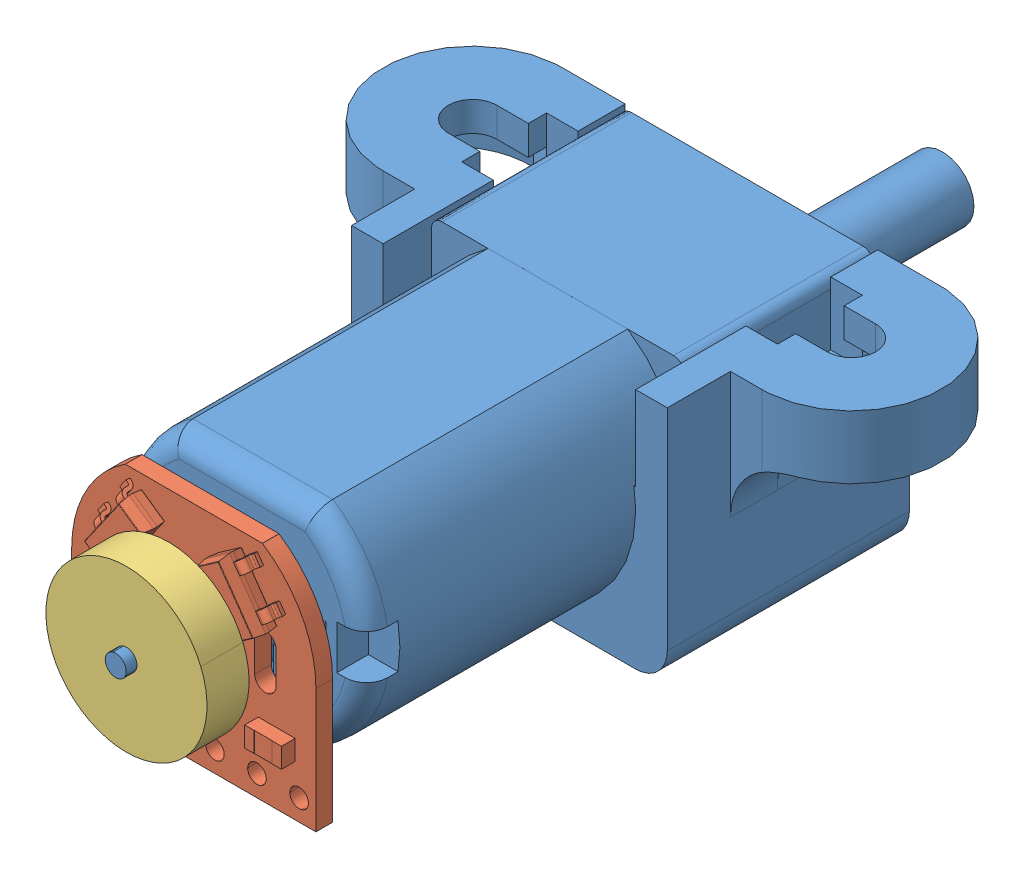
SolidWorks assembly Assem-motor.SLDASM, configuration Default (file format 14000). Lengths in mm.
Overall size (26.51 11.71 39.27).
3 component instances, 3 part files, 5 mates.
Components (placement in the parent):
- motor dual shaft-1: motor dual shaft.SLDPRT [Default] at (14.3298 18 -34.4067) x (0 0 -1) z (-1 0 0) size (39.27 11.71 26.51)
- motor-encoder1-1: motor-encoder1.SLDPRT [Default] at (14.3298 18 -17.9067) size (11.6 10.6 1.99)
- motor-encoder2-1: motor-encoder2.SLDPRT [Default] at (14.3298 18 -13.9167) x (-0.923728 -0.383049 0) z (0 0 -1) size (7.65 7.65 2)
Mates (geometry in assembly coordinates):
- Coincident6: coincident anti-aligned: plane of motor-encoder1-1 through (12.6867 19.95 -15.9167) normal (0 0 1); plane of motor-encoder2-1 through (14.3298 18 -15.9167) normal (0 0 -1)
- Concentric4: concentric anti-aligned: cylinder of motor-encoder1-1 through (14.3298 18 -17.1167) axis (0 0 -1) radius 0.8128; cylinder of motor-encoder2-1 through (14.3298 18 -15.9167) axis (0 0 1) radius 0.5
- Coincident7: coincident anti-aligned: plane of motor dual shaft-1 through (14.3298 18 -17.9067) normal (0 0 1); plane of motor-encoder1-1 through (14.5113 18.0974 -17.9067) normal (0 0 -1)
- Concentric5: concentric anti-aligned: cylinder of motor dual shaft-1 through (14.3298 18 -13.4067) axis (0 0 -1) radius 0.5; cylinder of motor-encoder2-1 through (14.3298 18 -15.9167) axis (0 0 1) radius 0.5
- Parallel3: parallel aligned: plane of motor dual shaft-1 through (14.3298 22.9999 -34.4067) normal (0 1 0); plane of motor-encoder1-1 through (17.5798 22.8 -17.1167) normal (0 1 0)
